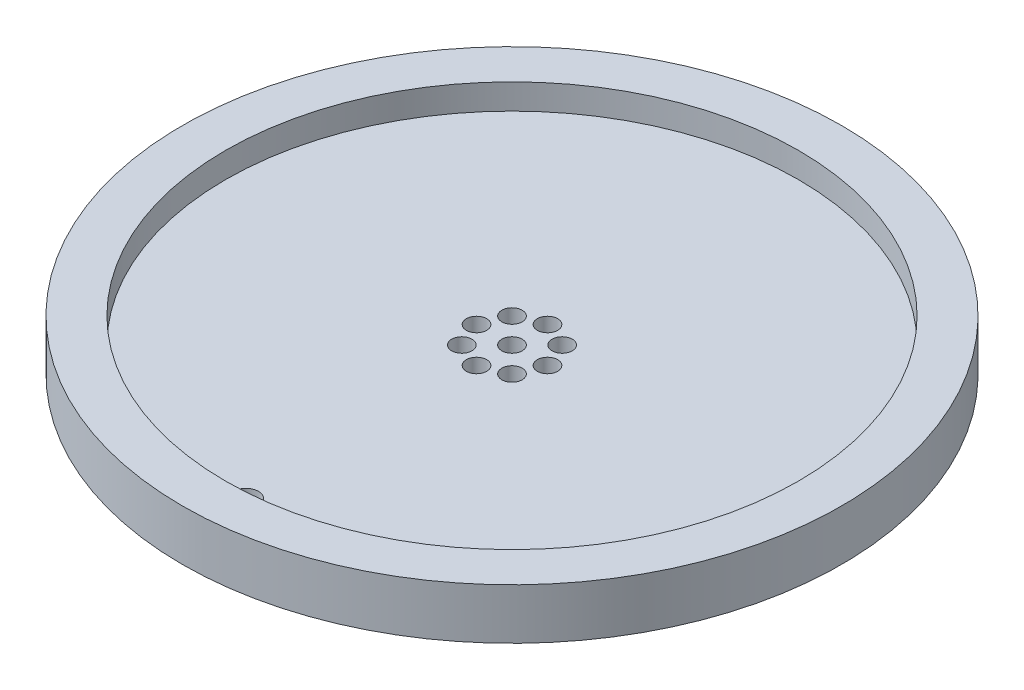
ISO-10303-21;
HEADER;
FILE_DESCRIPTION(('STEP AP214'),'2;1');
FILE_NAME('part.step','',(''),(''),'','','');
FILE_SCHEMA(('AUTOMOTIVE_DESIGN { 1 0 10303 214 1 1 1 1 }'));
ENDSEC;
DATA;
#1=APPLICATION_CONTEXT('core data for automotive mechanical design processes');
#2=APPLICATION_PROTOCOL_DEFINITION('international standard','automotive_design',2000,#1);
#3=PRODUCT_CONTEXT('',#1,'mechanical');
#4=PRODUCT('Part','Part','',(#3));
#5=PRODUCT_RELATED_PRODUCT_CATEGORY('part','',(#4));
#6=PRODUCT_DEFINITION_FORMATION('','',#4);
#7=PRODUCT_DEFINITION_CONTEXT('part definition',#1,'design');
#8=PRODUCT_DEFINITION('design','',#6,#7);
#9=PRODUCT_DEFINITION_SHAPE('','',#8);
#10=(LENGTH_UNIT() NAMED_UNIT(*) SI_UNIT(.MILLI.,.METRE.));
#11=(NAMED_UNIT(*) PLANE_ANGLE_UNIT() SI_UNIT($,.RADIAN.));
#12=(NAMED_UNIT(*) SI_UNIT($,.STERADIAN.) SOLID_ANGLE_UNIT());
#13=UNCERTAINTY_MEASURE_WITH_UNIT(LENGTH_MEASURE(1.E-05),#10,'distance_accuracy_value','');
#14=(GEOMETRIC_REPRESENTATION_CONTEXT(3) GLOBAL_UNCERTAINTY_ASSIGNED_CONTEXT((#13)) GLOBAL_UNIT_ASSIGNED_CONTEXT((#10,
#11,#12)) REPRESENTATION_CONTEXT('',''));
#15=CARTESIAN_POINT('',(0.,0.,0.));
#16=DIRECTION('',(0.,0.,1.));
#17=DIRECTION('',(1.,0.,0.));
#18=AXIS2_PLACEMENT_3D('',#15,#16,#17);
#19=CARTESIAN_POINT('',(0.,5.,0.));
#20=DIRECTION('',(0.,1.,0.));
#21=DIRECTION('',(0.,0.,1.));
#22=AXIS2_PLACEMENT_3D('',#19,#20,#21);
#23=PLANE('',#22);
#24=CARTESIAN_POINT('',(0.,5.,52.5));
#25=DIRECTION('',(0.,-1.,0.));
#26=DIRECTION('',(0.,0.,-1.));
#27=AXIS2_PLACEMENT_3D('',#24,#25,#26);
#28=CIRCLE('',#27,2.5);
#29=CARTESIAN_POINT('',(0.,5.,50.));
#30=VERTEX_POINT('',#29);
#31=EDGE_CURVE('E128',#30,#30,#28,.T.);
#32=ORIENTED_EDGE('',*,*,#31,.T.);
#33=EDGE_LOOP('',(#32));
#34=FACE_BOUND('',#33,.T.);
#35=CARTESIAN_POINT('',(-7.,5.,0.));
#36=DIRECTION('',(0.,1.,0.));
#37=DIRECTION('',(0.,0.,1.));
#38=AXIS2_PLACEMENT_3D('',#35,#36,#37);
#39=CIRCLE('',#38,2.);
#40=CARTESIAN_POINT('',(-7.,5.,2.));
#41=VERTEX_POINT('',#40);
#42=EDGE_CURVE('E112',#41,#41,#39,.T.);
#43=ORIENTED_EDGE('',*,*,#42,.F.);
#44=EDGE_LOOP('',(#43));
#45=FACE_BOUND('',#44,.T.);
#46=CARTESIAN_POINT('',(0.,5.,7.));
#47=DIRECTION('',(0.,1.,0.));
#48=DIRECTION('',(0.,0.,1.));
#49=AXIS2_PLACEMENT_3D('',#46,#47,#48);
#50=CIRCLE('',#49,2.);
#51=CARTESIAN_POINT('',(0.,5.,9.));
#52=VERTEX_POINT('',#51);
#53=EDGE_CURVE('E96',#52,#52,#50,.T.);
#54=ORIENTED_EDGE('',*,*,#53,.F.);
#55=EDGE_LOOP('',(#54));
#56=FACE_BOUND('',#55,.T.);
#57=CARTESIAN_POINT('',(7.,5.,0.));
#58=DIRECTION('',(0.,1.,0.));
#59=DIRECTION('',(0.,0.,1.));
#60=AXIS2_PLACEMENT_3D('',#57,#58,#59);
#61=CIRCLE('',#60,2.);
#62=CARTESIAN_POINT('',(7.,5.,2.));
#63=VERTEX_POINT('',#62);
#64=EDGE_CURVE('E80',#63,#63,#61,.T.);
#65=ORIENTED_EDGE('',*,*,#64,.F.);
#66=EDGE_LOOP('',(#65));
#67=FACE_BOUND('',#66,.T.);
#68=CARTESIAN_POINT('',(0.,5.,-7.));
#69=DIRECTION('',(0.,1.,0.));
#70=DIRECTION('',(0.,0.,1.));
#71=AXIS2_PLACEMENT_3D('',#68,#69,#70);
#72=CIRCLE('',#71,2.);
#73=CARTESIAN_POINT('',(0.,5.,-5.));
#74=VERTEX_POINT('',#73);
#75=EDGE_CURVE('E66',#74,#74,#72,.T.);
#76=ORIENTED_EDGE('',*,*,#75,.F.);
#77=EDGE_LOOP('',(#76));
#78=FACE_BOUND('',#77,.T.);
#79=CARTESIAN_POINT('',(0.,5.,0.));
#80=DIRECTION('',(0.,1.,0.));
#81=DIRECTION('',(0.,0.,1.));
#82=AXIS2_PLACEMENT_3D('',#79,#80,#81);
#83=CIRCLE('',#82,2.);
#84=CARTESIAN_POINT('',(0.,5.,2.));
#85=VERTEX_POINT('',#84);
#86=EDGE_CURVE('E56',#85,#85,#83,.T.);
#87=ORIENTED_EDGE('',*,*,#86,.F.);
#88=EDGE_LOOP('',(#87));
#89=FACE_BOUND('',#88,.T.);
#90=CARTESIAN_POINT('',(4.9497474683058,5.,-4.94974746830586));
#91=DIRECTION('',(0.,1.,0.));
#92=DIRECTION('',(0.,0.,1.));
#93=AXIS2_PLACEMENT_3D('',#90,#91,#92);
#94=CIRCLE('',#93,2.);
#95=CARTESIAN_POINT('',(4.9497474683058,5.,-2.94974746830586));
#96=VERTEX_POINT('',#95);
#97=EDGE_CURVE('E72',#96,#96,#94,.T.);
#98=ORIENTED_EDGE('',*,*,#97,.F.);
#99=EDGE_LOOP('',(#98));
#100=FACE_BOUND('',#99,.T.);
#101=CARTESIAN_POINT('',(4.94974746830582,5.,4.94974746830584));
#102=DIRECTION('',(0.,1.,0.));
#103=DIRECTION('',(0.,0.,1.));
#104=AXIS2_PLACEMENT_3D('',#101,#102,#103);
#105=CIRCLE('',#104,2.);
#106=CARTESIAN_POINT('',(4.94974746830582,5.,6.94974746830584));
#107=VERTEX_POINT('',#106);
#108=EDGE_CURVE('E88',#107,#107,#105,.T.);
#109=ORIENTED_EDGE('',*,*,#108,.F.);
#110=EDGE_LOOP('',(#109));
#111=FACE_BOUND('',#110,.T.);
#112=CARTESIAN_POINT('',(-4.94974746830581,5.,4.94974746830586));
#113=DIRECTION('',(0.,1.,0.));
#114=DIRECTION('',(0.,0.,1.));
#115=AXIS2_PLACEMENT_3D('',#112,#113,#114);
#116=CIRCLE('',#115,2.);
#117=CARTESIAN_POINT('',(-4.94974746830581,5.,6.94974746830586));
#118=VERTEX_POINT('',#117);
#119=EDGE_CURVE('E104',#118,#118,#116,.T.);
#120=ORIENTED_EDGE('',*,*,#119,.F.);
#121=EDGE_LOOP('',(#120));
#122=FACE_BOUND('',#121,.T.);
#123=CARTESIAN_POINT('',(-4.94974746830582,5.,-4.94974746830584));
#124=DIRECTION('',(0.,1.,0.));
#125=DIRECTION('',(0.,0.,1.));
#126=AXIS2_PLACEMENT_3D('',#123,#124,#125);
#127=CIRCLE('',#126,2.);
#128=CARTESIAN_POINT('',(-4.94974746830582,5.,-2.94974746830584));
#129=VERTEX_POINT('',#128);
#130=EDGE_CURVE('E120',#129,#129,#127,.T.);
#131=ORIENTED_EDGE('',*,*,#130,.F.);
#132=EDGE_LOOP('',(#131));
#133=FACE_BOUND('',#132,.T.);
#134=CARTESIAN_POINT('',(0.,5.,0.));
#135=DIRECTION('',(0.,1.,0.));
#136=DIRECTION('',(0.,0.,1.));
#137=AXIS2_PLACEMENT_3D('',#134,#135,#136);
#138=CIRCLE('',#137,56.5);
#139=CARTESIAN_POINT('',(0.,5.,56.5));
#140=VERTEX_POINT('',#139);
#141=EDGE_CURVE('E10',#140,#140,#138,.F.);
#142=ORIENTED_EDGE('',*,*,#141,.F.);
#143=EDGE_LOOP('',(#142));
#144=FACE_BOUND('',#143,.T.);
#145=ADVANCED_FACE('F43',(#34,#45,#56,#67,#78,#89,#100,#111,#122,#133,#144),#23,.T.);
#146=CARTESIAN_POINT('',(0.,0.,0.));
#147=DIRECTION('',(0.,1.,0.));
#148=DIRECTION('',(0.,0.,1.));
#149=AXIS2_PLACEMENT_3D('',#146,#147,#148);
#150=PLANE('',#149);
#151=CARTESIAN_POINT('',(0.,0.,52.5));
#152=DIRECTION('',(0.,-1.,0.));
#153=DIRECTION('',(0.,0.,-1.));
#154=AXIS2_PLACEMENT_3D('',#151,#152,#153);
#155=CIRCLE('',#154,2.5);
#156=CARTESIAN_POINT('',(0.,0.,50.));
#157=VERTEX_POINT('',#156);
#158=EDGE_CURVE('E132',#157,#157,#155,.T.);
#159=ORIENTED_EDGE('',*,*,#158,.F.);
#160=EDGE_LOOP('',(#159));
#161=FACE_BOUND('',#160,.T.);
#162=CARTESIAN_POINT('',(0.,0.,0.));
#163=DIRECTION('',(0.,1.,0.));
#164=DIRECTION('',(0.,0.,1.));
#165=AXIS2_PLACEMENT_3D('',#162,#163,#164);
#166=CIRCLE('',#165,65.);
#167=CARTESIAN_POINT('',(0.,0.,65.));
#168=VERTEX_POINT('',#167);
#169=EDGE_CURVE('E51',#168,#168,#166,.T.);
#170=ORIENTED_EDGE('',*,*,#169,.F.);
#171=EDGE_LOOP('',(#170));
#172=FACE_BOUND('',#171,.T.);
#173=CARTESIAN_POINT('',(0.,0.,0.));
#174=DIRECTION('',(0.,1.,0.));
#175=DIRECTION('',(0.,0.,1.));
#176=AXIS2_PLACEMENT_3D('',#173,#174,#175);
#177=CIRCLE('',#176,2.);
#178=CARTESIAN_POINT('',(0.,0.,2.));
#179=VERTEX_POINT('',#178);
#180=EDGE_CURVE('E61',#179,#179,#177,.T.);
#181=ORIENTED_EDGE('',*,*,#180,.T.);
#182=EDGE_LOOP('',(#181));
#183=FACE_BOUND('',#182,.T.);
#184=CARTESIAN_POINT('',(0.,0.,-7.));
#185=DIRECTION('',(0.,1.,0.));
#186=DIRECTION('',(0.,0.,1.));
#187=AXIS2_PLACEMENT_3D('',#184,#185,#186);
#188=CIRCLE('',#187,2.);
#189=CARTESIAN_POINT('',(0.,0.,-5.));
#190=VERTEX_POINT('',#189);
#191=EDGE_CURVE('E68',#190,#190,#188,.T.);
#192=ORIENTED_EDGE('',*,*,#191,.T.);
#193=EDGE_LOOP('',(#192));
#194=FACE_BOUND('',#193,.T.);
#195=CARTESIAN_POINT('',(4.9497474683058,0.,-4.94974746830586));
#196=DIRECTION('',(0.,1.,0.));
#197=DIRECTION('',(0.,0.,1.));
#198=AXIS2_PLACEMENT_3D('',#195,#196,#197);
#199=CIRCLE('',#198,2.);
#200=CARTESIAN_POINT('',(4.9497474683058,0.,-2.94974746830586));
#201=VERTEX_POINT('',#200);
#202=EDGE_CURVE('E76',#201,#201,#199,.T.);
#203=ORIENTED_EDGE('',*,*,#202,.T.);
#204=EDGE_LOOP('',(#203));
#205=FACE_BOUND('',#204,.T.);
#206=CARTESIAN_POINT('',(7.,0.,0.));
#207=DIRECTION('',(0.,1.,0.));
#208=DIRECTION('',(0.,0.,1.));
#209=AXIS2_PLACEMENT_3D('',#206,#207,#208);
#210=CIRCLE('',#209,2.);
#211=CARTESIAN_POINT('',(7.,0.,2.));
#212=VERTEX_POINT('',#211);
#213=EDGE_CURVE('E84',#212,#212,#210,.T.);
#214=ORIENTED_EDGE('',*,*,#213,.T.);
#215=EDGE_LOOP('',(#214));
#216=FACE_BOUND('',#215,.T.);
#217=CARTESIAN_POINT('',(4.94974746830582,0.,4.94974746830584));
#218=DIRECTION('',(0.,1.,0.));
#219=DIRECTION('',(0.,0.,1.));
#220=AXIS2_PLACEMENT_3D('',#217,#218,#219);
#221=CIRCLE('',#220,2.);
#222=CARTESIAN_POINT('',(4.94974746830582,0.,6.94974746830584));
#223=VERTEX_POINT('',#222);
#224=EDGE_CURVE('E92',#223,#223,#221,.T.);
#225=ORIENTED_EDGE('',*,*,#224,.T.);
#226=EDGE_LOOP('',(#225));
#227=FACE_BOUND('',#226,.T.);
#228=CARTESIAN_POINT('',(0.,0.,7.));
#229=DIRECTION('',(0.,1.,0.));
#230=DIRECTION('',(0.,0.,1.));
#231=AXIS2_PLACEMENT_3D('',#228,#229,#230);
#232=CIRCLE('',#231,2.);
#233=CARTESIAN_POINT('',(0.,0.,9.));
#234=VERTEX_POINT('',#233);
#235=EDGE_CURVE('E100',#234,#234,#232,.T.);
#236=ORIENTED_EDGE('',*,*,#235,.T.);
#237=EDGE_LOOP('',(#236));
#238=FACE_BOUND('',#237,.T.);
#239=CARTESIAN_POINT('',(-4.94974746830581,0.,4.94974746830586));
#240=DIRECTION('',(0.,1.,0.));
#241=DIRECTION('',(0.,0.,1.));
#242=AXIS2_PLACEMENT_3D('',#239,#240,#241);
#243=CIRCLE('',#242,2.);
#244=CARTESIAN_POINT('',(-4.94974746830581,0.,6.94974746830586));
#245=VERTEX_POINT('',#244);
#246=EDGE_CURVE('E108',#245,#245,#243,.T.);
#247=ORIENTED_EDGE('',*,*,#246,.T.);
#248=EDGE_LOOP('',(#247));
#249=FACE_BOUND('',#248,.T.);
#250=CARTESIAN_POINT('',(-7.,0.,0.));
#251=DIRECTION('',(0.,1.,0.));
#252=DIRECTION('',(0.,0.,1.));
#253=AXIS2_PLACEMENT_3D('',#250,#251,#252);
#254=CIRCLE('',#253,2.);
#255=CARTESIAN_POINT('',(-7.,0.,2.));
#256=VERTEX_POINT('',#255);
#257=EDGE_CURVE('E116',#256,#256,#254,.T.);
#258=ORIENTED_EDGE('',*,*,#257,.T.);
#259=EDGE_LOOP('',(#258));
#260=FACE_BOUND('',#259,.T.);
#261=CARTESIAN_POINT('',(-4.94974746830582,0.,-4.94974746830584));
#262=DIRECTION('',(0.,1.,0.));
#263=DIRECTION('',(0.,0.,1.));
#264=AXIS2_PLACEMENT_3D('',#261,#262,#263);
#265=CIRCLE('',#264,2.);
#266=CARTESIAN_POINT('',(-4.94974746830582,0.,-2.94974746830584));
#267=VERTEX_POINT('',#266);
#268=EDGE_CURVE('E124',#267,#267,#265,.T.);
#269=ORIENTED_EDGE('',*,*,#268,.T.);
#270=EDGE_LOOP('',(#269));
#271=FACE_BOUND('',#270,.T.);
#272=ADVANCED_FACE('F164',(#161,#172,#183,#194,#205,#216,#227,#238,#249,#260,#271),#150,.F.);
#273=CARTESIAN_POINT('',(0.,5.,0.));
#274=DIRECTION('',(0.,-1.,0.));
#275=DIRECTION('',(0.,0.,-1.));
#276=AXIS2_PLACEMENT_3D('',#273,#274,#275);
#277=CYLINDRICAL_SURFACE('',#276,65.);
#278=ORIENTED_EDGE('',*,*,#169,.T.);
#279=EDGE_LOOP('',(#278));
#280=FACE_BOUND('',#279,.T.);
#281=CARTESIAN_POINT('',(0.,10.,0.));
#282=DIRECTION('',(0.,1.,0.));
#283=DIRECTION('',(0.,0.,1.));
#284=AXIS2_PLACEMENT_3D('',#281,#282,#283);
#285=CIRCLE('',#284,65.);
#286=CARTESIAN_POINT('',(0.,10.,65.));
#287=VERTEX_POINT('',#286);
#288=EDGE_CURVE('E136',#287,#287,#285,.T.);
#289=ORIENTED_EDGE('',*,*,#288,.F.);
#290=EDGE_LOOP('',(#289));
#291=FACE_BOUND('',#290,.T.);
#292=ADVANCED_FACE('F45',(#280,#291),#277,.T.);
#293=CARTESIAN_POINT('',(0.,5.,0.));
#294=DIRECTION('',(0.,-1.,0.));
#295=DIRECTION('',(0.,0.,-1.));
#296=AXIS2_PLACEMENT_3D('',#293,#294,#295);
#297=CYLINDRICAL_SURFACE('',#296,2.);
#298=ORIENTED_EDGE('',*,*,#86,.T.);
#299=EDGE_LOOP('',(#298));
#300=FACE_BOUND('',#299,.T.);
#301=ORIENTED_EDGE('',*,*,#180,.F.);
#302=EDGE_LOOP('',(#301));
#303=FACE_BOUND('',#302,.T.);
#304=ADVANCED_FACE('F174',(#300,#303),#297,.F.);
#305=CARTESIAN_POINT('',(0.,5.,-7.));
#306=DIRECTION('',(0.,-1.,0.));
#307=DIRECTION('',(0.,0.,-1.));
#308=AXIS2_PLACEMENT_3D('',#305,#306,#307);
#309=CYLINDRICAL_SURFACE('',#308,2.);
#310=ORIENTED_EDGE('',*,*,#75,.T.);
#311=EDGE_LOOP('',(#310));
#312=FACE_BOUND('',#311,.T.);
#313=ORIENTED_EDGE('',*,*,#191,.F.);
#314=EDGE_LOOP('',(#313));
#315=FACE_BOUND('',#314,.T.);
#316=ADVANCED_FACE('F177',(#312,#315),#309,.F.);
#317=CARTESIAN_POINT('',(4.9497474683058,5.,-4.94974746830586));
#318=DIRECTION('',(0.,-1.,0.));
#319=DIRECTION('',(0.,0.,-1.));
#320=AXIS2_PLACEMENT_3D('',#317,#318,#319);
#321=CYLINDRICAL_SURFACE('',#320,2.);
#322=ORIENTED_EDGE('',*,*,#97,.T.);
#323=EDGE_LOOP('',(#322));
#324=FACE_BOUND('',#323,.T.);
#325=ORIENTED_EDGE('',*,*,#202,.F.);
#326=EDGE_LOOP('',(#325));
#327=FACE_BOUND('',#326,.T.);
#328=ADVANCED_FACE('F181',(#324,#327),#321,.F.);
#329=CARTESIAN_POINT('',(7.,5.,0.));
#330=DIRECTION('',(0.,-1.,0.));
#331=DIRECTION('',(0.,0.,-1.));
#332=AXIS2_PLACEMENT_3D('',#329,#330,#331);
#333=CYLINDRICAL_SURFACE('',#332,2.);
#334=ORIENTED_EDGE('',*,*,#64,.T.);
#335=EDGE_LOOP('',(#334));
#336=FACE_BOUND('',#335,.T.);
#337=ORIENTED_EDGE('',*,*,#213,.F.);
#338=EDGE_LOOP('',(#337));
#339=FACE_BOUND('',#338,.T.);
#340=ADVANCED_FACE('F185',(#336,#339),#333,.F.);
#341=CARTESIAN_POINT('',(4.94974746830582,5.,4.94974746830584));
#342=DIRECTION('',(0.,-1.,0.));
#343=DIRECTION('',(0.,0.,-1.));
#344=AXIS2_PLACEMENT_3D('',#341,#342,#343);
#345=CYLINDRICAL_SURFACE('',#344,2.);
#346=ORIENTED_EDGE('',*,*,#108,.T.);
#347=EDGE_LOOP('',(#346));
#348=FACE_BOUND('',#347,.T.);
#349=ORIENTED_EDGE('',*,*,#224,.F.);
#350=EDGE_LOOP('',(#349));
#351=FACE_BOUND('',#350,.T.);
#352=ADVANCED_FACE('F189',(#348,#351),#345,.F.);
#353=CARTESIAN_POINT('',(0.,5.,7.));
#354=DIRECTION('',(0.,-1.,0.));
#355=DIRECTION('',(0.,0.,-1.));
#356=AXIS2_PLACEMENT_3D('',#353,#354,#355);
#357=CYLINDRICAL_SURFACE('',#356,2.);
#358=ORIENTED_EDGE('',*,*,#53,.T.);
#359=EDGE_LOOP('',(#358));
#360=FACE_BOUND('',#359,.T.);
#361=ORIENTED_EDGE('',*,*,#235,.F.);
#362=EDGE_LOOP('',(#361));
#363=FACE_BOUND('',#362,.T.);
#364=ADVANCED_FACE('F193',(#360,#363),#357,.F.);
#365=CARTESIAN_POINT('',(-4.94974746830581,5.,4.94974746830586));
#366=DIRECTION('',(0.,-1.,0.));
#367=DIRECTION('',(0.,0.,-1.));
#368=AXIS2_PLACEMENT_3D('',#365,#366,#367);
#369=CYLINDRICAL_SURFACE('',#368,2.);
#370=ORIENTED_EDGE('',*,*,#119,.T.);
#371=EDGE_LOOP('',(#370));
#372=FACE_BOUND('',#371,.T.);
#373=ORIENTED_EDGE('',*,*,#246,.F.);
#374=EDGE_LOOP('',(#373));
#375=FACE_BOUND('',#374,.T.);
#376=ADVANCED_FACE('F197',(#372,#375),#369,.F.);
#377=CARTESIAN_POINT('',(-7.,5.,0.));
#378=DIRECTION('',(0.,-1.,0.));
#379=DIRECTION('',(0.,0.,-1.));
#380=AXIS2_PLACEMENT_3D('',#377,#378,#379);
#381=CYLINDRICAL_SURFACE('',#380,2.);
#382=ORIENTED_EDGE('',*,*,#42,.T.);
#383=EDGE_LOOP('',(#382));
#384=FACE_BOUND('',#383,.T.);
#385=ORIENTED_EDGE('',*,*,#257,.F.);
#386=EDGE_LOOP('',(#385));
#387=FACE_BOUND('',#386,.T.);
#388=ADVANCED_FACE('F201',(#384,#387),#381,.F.);
#389=CARTESIAN_POINT('',(-4.94974746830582,5.,-4.94974746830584));
#390=DIRECTION('',(0.,-1.,0.));
#391=DIRECTION('',(0.,0.,-1.));
#392=AXIS2_PLACEMENT_3D('',#389,#390,#391);
#393=CYLINDRICAL_SURFACE('',#392,2.);
#394=ORIENTED_EDGE('',*,*,#130,.T.);
#395=EDGE_LOOP('',(#394));
#396=FACE_BOUND('',#395,.T.);
#397=ORIENTED_EDGE('',*,*,#268,.F.);
#398=EDGE_LOOP('',(#397));
#399=FACE_BOUND('',#398,.T.);
#400=ADVANCED_FACE('F161',(#396,#399),#393,.F.);
#401=CARTESIAN_POINT('',(0.,5.,52.5));
#402=DIRECTION('',(0.,-1.,0.));
#403=DIRECTION('',(0.,0.,-1.));
#404=AXIS2_PLACEMENT_3D('',#401,#402,#403);
#405=CYLINDRICAL_SURFACE('',#404,2.5);
#406=ORIENTED_EDGE('',*,*,#31,.F.);
#407=EDGE_LOOP('',(#406));
#408=FACE_BOUND('',#407,.T.);
#409=ORIENTED_EDGE('',*,*,#158,.T.);
#410=EDGE_LOOP('',(#409));
#411=FACE_BOUND('',#410,.T.);
#412=ADVANCED_FACE('F152',(#408,#411),#405,.F.);
#413=CARTESIAN_POINT('',(0.,10.,0.));
#414=DIRECTION('',(0.,1.,0.));
#415=DIRECTION('',(0.,0.,1.));
#416=AXIS2_PLACEMENT_3D('',#413,#414,#415);
#417=PLANE('',#416);
#418=ORIENTED_EDGE('',*,*,#288,.T.);
#419=EDGE_LOOP('',(#418));
#420=FACE_BOUND('',#419,.T.);
#421=CARTESIAN_POINT('',(0.,10.,0.));
#422=DIRECTION('',(0.,1.,0.));
#423=DIRECTION('',(0.,0.,1.));
#424=AXIS2_PLACEMENT_3D('',#421,#422,#423);
#425=CIRCLE('',#424,56.5);
#426=CARTESIAN_POINT('',(0.,10.,56.5));
#427=VERTEX_POINT('',#426);
#428=EDGE_CURVE('E143',#427,#427,#425,.T.);
#429=ORIENTED_EDGE('',*,*,#428,.F.);
#430=EDGE_LOOP('',(#429));
#431=FACE_BOUND('',#430,.T.);
#432=ADVANCED_FACE('F150',(#420,#431),#417,.T.);
#433=CARTESIAN_POINT('',(0.,176.877200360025,0.));
#434=DIRECTION('',(0.,-1.,0.));
#435=DIRECTION('',(0.,0.,-1.));
#436=AXIS2_PLACEMENT_3D('',#433,#434,#435);
#437=CYLINDRICAL_SURFACE('',#436,56.5);
#438=ORIENTED_EDGE('',*,*,#141,.T.);
#439=EDGE_LOOP('',(#438));
#440=FACE_BOUND('',#439,.T.);
#441=ORIENTED_EDGE('',*,*,#428,.T.);
#442=EDGE_LOOP('',(#441));
#443=FACE_BOUND('',#442,.T.);
#444=ADVANCED_FACE('F148',(#440,#443),#437,.F.);
#445=CLOSED_SHELL('',(#145,#272,#292,#304,#316,#328,#340,#352,#364,#376,#388,#400,#412,#432,#444));
#446=MANIFOLD_SOLID_BREP('B2',#445);
#447=ADVANCED_BREP_SHAPE_REPRESENTATION('',(#18,#446),#14);
#448=SHAPE_DEFINITION_REPRESENTATION(#9,#447);
ENDSEC;
END-ISO-10303-21;
